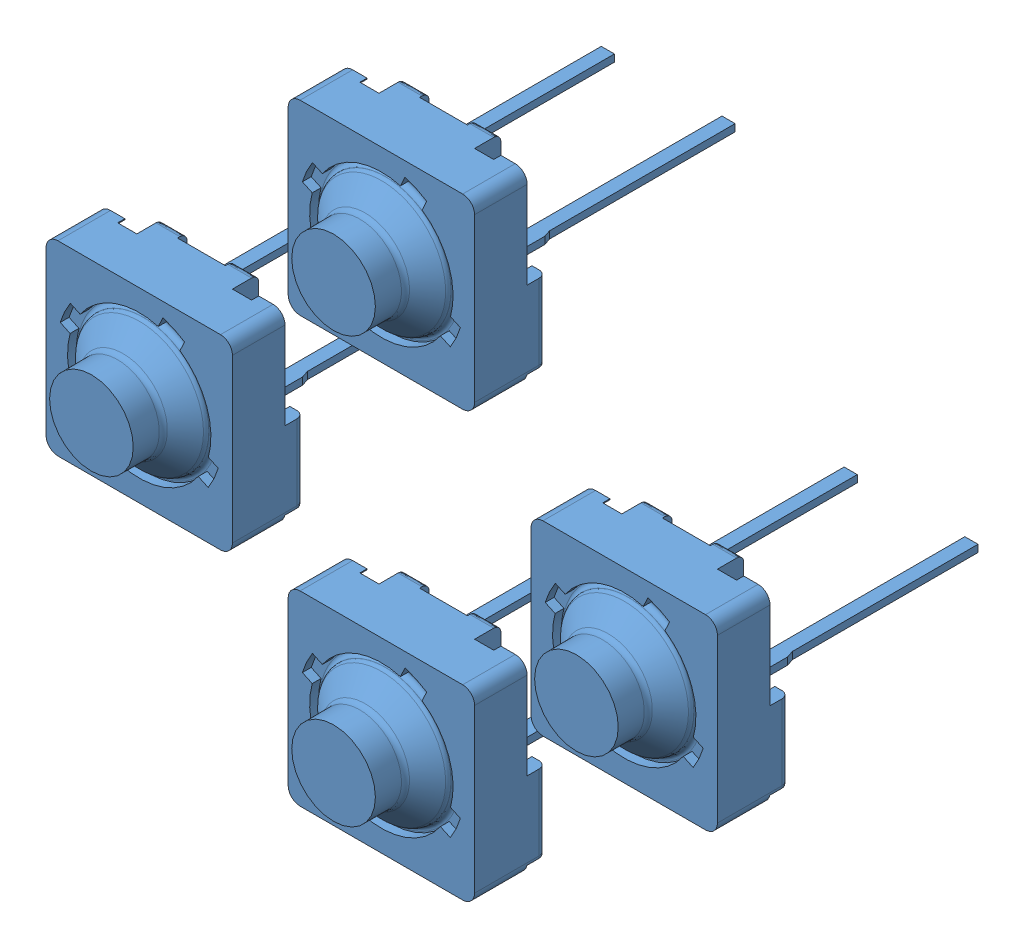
SolidWorks assembly Action.SLDASM, configuration Default (file format 6000). Lengths in mm.
Overall size (28.11 25.78 14).
4 component instances, 1 part files, 9 mates.
Components (placement in the parent):
- SKPDAM-1: SKPDAM.SLDPRT [Default] at (-81.9261 13.7213 35.9788) size (7.82 8 14)
- SKPDAM-2: SKPDAM.SLDPRT [Default] at (-71.7961 23.8813 35.9788) size (7.82 8 14)
- SKPDAM-3: SKPDAM.SLDPRT [Default] at (-61.6361 13.7213 35.9788) size (7.82 8 14)
- SKPDAM-4: SKPDAM.SLDPRT [Default] at (-71.7961 6.1013 35.9788) size (7.82 8 14)
Mates (geometry in assembly coordinates):
- Coincident1: coincident aligned: plane of SKPDAM-1 through (-78.5261 17.1213 35.9788) normal (0 0 -1); plane of SKPDAM-2 through (-75.1961 27.2813 35.9788) normal (0 0 -1)
- Coincident2: coincident aligned: plane of SKPDAM-1 through (-78.5261 17.1213 35.9788) normal (0 0 -1); plane of SKPDAM-4 through (-75.1961 9.5013 35.9788) normal (0 0 -1)
- Coincident3: coincident aligned: plane of SKPDAM-1 through (-78.5261 17.1213 35.9788) normal (0 0 -1); plane of SKPDAM-3 through (-65.0361 17.1213 35.9788) normal (0 0 -1)
- Distance1: distance = 5.08 mm aligned: plane of SKPDAM-1 through (-79.6761 13.8713 35.743) normal (-1 0 0); plane of SKPDAM-4 through (-74.5961 6.2513 26.343) normal (-1 0 0)
- Distance2: distance = 7.62 mm aligned: plane of SKPDAM-1 through (-79.9261 13.8713 39.593) normal (0 1 0); plane of SKPDAM-4 through (-73.7961 6.2513 39.593) normal (0 1 0)
- Distance3: distance = 10.16 mm aligned: plane of SKPDAM-2 through (-73.7961 24.0313 39.593) normal (0 1 0); plane of SKPDAM-1 through (-79.9261 13.8713 39.593) normal (0 1 0)
- Coincident6: coincident aligned: plane of SKPDAM-2 through (-75.6961 23.8813 38.9788) normal (-1 0 0); plane of SKPDAM-4 through (-75.6961 6.1013 38.9788) normal (-1 0 0)
- Distance4: distance = 15.24 mm aligned: plane of SKPDAM-1 through (-79.6761 13.8713 35.743) normal (-1 0 0); plane of SKPDAM-3 through (-64.4361 13.8713 26.343) normal (-1 0 0)
- Coincident8: coincident aligned: plane of SKPDAM-1 through (-81.9261 17.6213 38.9788) normal (0 1 0); plane of SKPDAM-3 through (-61.6361 17.6213 38.9788) normal (0 1 0)
